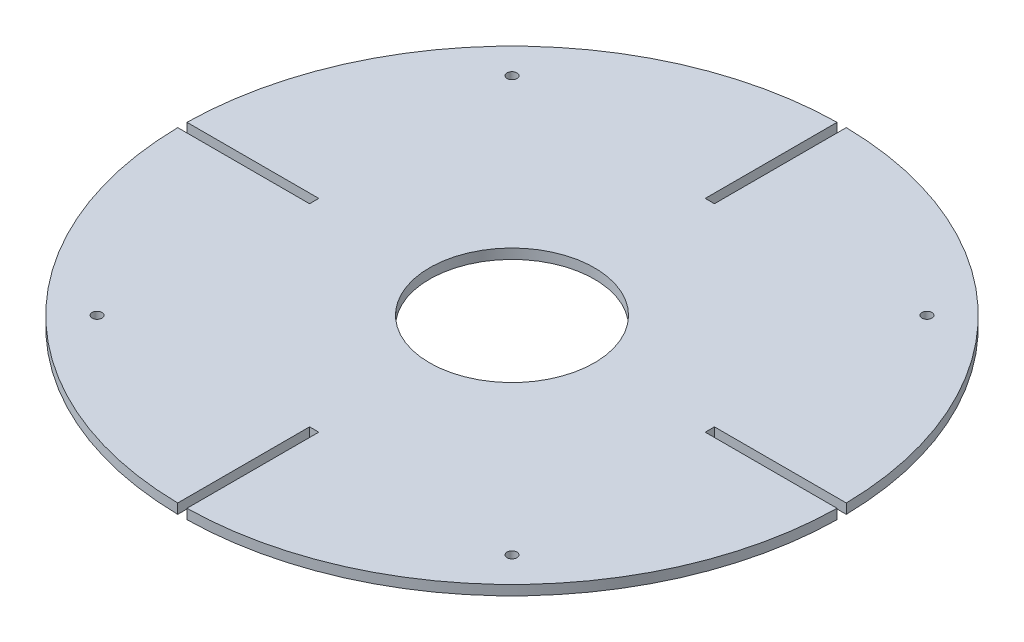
from build123d import *

# Parameters (mm, degrees)
SKETCH2_R           = 25
SKETCH2_R_2         = 1.5
BOSS_EXTRUDE1_DEPTH = 3


with BuildPart() as part:
    # Sketch2 → Boss-Extrude1 (new body)
    with BuildSketch(Plane(origin=(0, 0, 0), x_dir=(1, 0, 0), z_dir=(0, 1, 0))):
        with BuildLine():
            Line((-100.004583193, 98.550004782), (-139.99202778, 98.550004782))
            ThreePointArc((-139.99202778, 98.550004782), (-110.711970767, 29.238034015), (-41.4, -0.042022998))
            Line((-41.4, -0.042022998), (-41.4, 39.949447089))
            Line((-41.4, 39.949447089), (-38.6, 39.949447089))
            Line((-38.6, 39.949447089), (-38.6, -0.042022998))
            ThreePointArc((-38.6, -0.042022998), (30.711970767, 29.238034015), (59.99202778, 98.550004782))
            Line((59.99202778, 98.550004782), (20.004583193, 98.550004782))
            Line((20.004583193, 98.550004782), (20.004583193, 101.350004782))
            Line((20.004583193, 101.350004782), (59.99202778, 101.350004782))
            ThreePointArc((59.99202778, 101.350004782), (30.711970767, 170.66197555), (-38.6, 199.942032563))
            Line((-38.6, 199.942032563), (-38.6, 159.953870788))
            Line((-38.6, 159.953870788), (-41.4, 159.953870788))
            Line((-41.4, 159.953870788), (-41.4, 199.942032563))
            ThreePointArc((-41.4, 199.942032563), (-110.711970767, 170.66197555), (-139.99202778, 101.350004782))
            Line((-139.99202778, 101.350004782), (-100.004583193, 101.350004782))
            Line((-100.004583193, 101.350004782), (-100.004583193, 98.550004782))
        make_face()
        with Locations(Location((-40, 99.950004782, 0), (0, 0, 270))):
            Circle(SKETCH2_R, mode=Mode.SUBTRACT)
        with Locations(Location((-102.932503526, 162.882508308, 0), (0, 0, 270))):
            Circle(SKETCH2_R_2, mode=Mode.SUBTRACT)
        with Locations(Location((22.932503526, 162.882508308, 0), (0, 0, 270))):
            Circle(SKETCH2_R_2, mode=Mode.SUBTRACT)
        with Locations(Location((22.932503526, 37.017501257, 0), (0, 0, 270))):
            Circle(SKETCH2_R_2, mode=Mode.SUBTRACT)
        with Locations(Location((-102.932503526, 37.017501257, 0), (0, 0, 270))):
            Circle(SKETCH2_R_2, mode=Mode.SUBTRACT)
    extrude(amount=BOSS_EXTRUDE1_DEPTH)


solid = part.part
